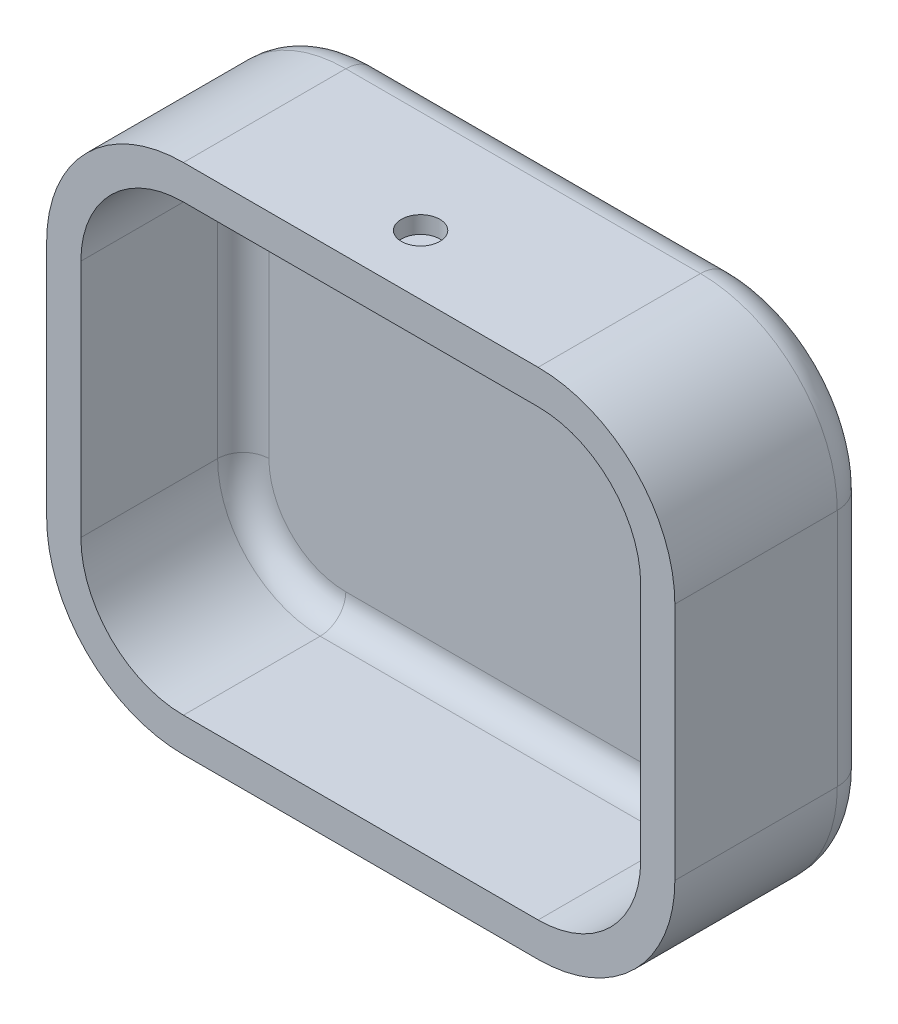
ISO-10303-21;
HEADER;
FILE_DESCRIPTION(('STEP AP214'),'2;1');
FILE_NAME('part.step','',(''),(''),'','','');
FILE_SCHEMA(('AUTOMOTIVE_DESIGN { 1 0 10303 214 1 1 1 1 }'));
ENDSEC;
DATA;
#1=APPLICATION_CONTEXT('core data for automotive mechanical design processes');
#2=APPLICATION_PROTOCOL_DEFINITION('international standard','automotive_design',2000,#1);
#3=PRODUCT_CONTEXT('',#1,'mechanical');
#4=PRODUCT('Part','Part','',(#3));
#5=PRODUCT_RELATED_PRODUCT_CATEGORY('part','',(#4));
#6=PRODUCT_DEFINITION_FORMATION('','',#4);
#7=PRODUCT_DEFINITION_CONTEXT('part definition',#1,'design');
#8=PRODUCT_DEFINITION('design','',#6,#7);
#9=PRODUCT_DEFINITION_SHAPE('','',#8);
#10=(LENGTH_UNIT() NAMED_UNIT(*) SI_UNIT(.MILLI.,.METRE.));
#11=(NAMED_UNIT(*) PLANE_ANGLE_UNIT() SI_UNIT($,.RADIAN.));
#12=(NAMED_UNIT(*) SI_UNIT($,.STERADIAN.) SOLID_ANGLE_UNIT());
#13=UNCERTAINTY_MEASURE_WITH_UNIT(LENGTH_MEASURE(1.E-05),#10,'distance_accuracy_value','');
#14=(GEOMETRIC_REPRESENTATION_CONTEXT(3) GLOBAL_UNCERTAINTY_ASSIGNED_CONTEXT((#13)) GLOBAL_UNIT_ASSIGNED_CONTEXT((#10,
#11,#12)) REPRESENTATION_CONTEXT('',''));
#15=CARTESIAN_POINT('',(0.,0.,0.));
#16=DIRECTION('',(0.,0.,1.));
#17=DIRECTION('',(1.,0.,0.));
#18=AXIS2_PLACEMENT_3D('',#15,#16,#17);
#19=CARTESIAN_POINT('',(12.,40.,19.));
#20=DIRECTION('',(0.,0.,1.));
#21=DIRECTION('',(1.,0.,0.));
#22=AXIS2_PLACEMENT_3D('',#19,#20,#21);
#23=PLANE('',#22);
#24=CARTESIAN_POINT('',(12.,40.,19.));
#25=DIRECTION('',(0.,0.,1.));
#26=DIRECTION('',(1.,0.,0.));
#27=AXIS2_PLACEMENT_3D('',#24,#25,#26);
#28=CIRCLE('',#27,16.);
#29=CARTESIAN_POINT('',(12.0000000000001,56.,19.));
#30=VERTEX_POINT('',#29);
#31=CARTESIAN_POINT('',(-4.,39.9999999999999,19.));
#32=VERTEX_POINT('',#31);
#33=EDGE_CURVE('E216',#30,#32,#28,.T.);
#34=ORIENTED_EDGE('',*,*,#33,.T.);
#35=DIRECTION('',(0.,-1.,0.));
#36=VECTOR('',#35,1.);
#37=CARTESIAN_POINT('',(-4.,12.0000000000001,19.));
#38=LINE('',#37,#36);
#39=CARTESIAN_POINT('',(-4.,12.0000000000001,19.));
#40=VERTEX_POINT('',#39);
#41=EDGE_CURVE('E253',#32,#40,#38,.T.);
#42=ORIENTED_EDGE('',*,*,#41,.T.);
#43=CARTESIAN_POINT('',(12.,12.,19.));
#44=DIRECTION('',(0.,0.,1.));
#45=DIRECTION('',(1.,0.,0.));
#46=AXIS2_PLACEMENT_3D('',#43,#44,#45);
#47=CIRCLE('',#46,16.);
#48=CARTESIAN_POINT('',(12.0000000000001,-4.,19.));
#49=VERTEX_POINT('',#48);
#50=EDGE_CURVE('E255',#40,#49,#47,.T.);
#51=ORIENTED_EDGE('',*,*,#50,.T.);
#52=DIRECTION('',(1.,0.,0.));
#53=VECTOR('',#52,1.);
#54=CARTESIAN_POINT('',(53.4999999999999,-4.,19.));
#55=LINE('',#54,#53);
#56=CARTESIAN_POINT('',(53.4999999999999,-4.,19.));
#57=VERTEX_POINT('',#56);
#58=EDGE_CURVE('E257',#49,#57,#55,.T.);
#59=ORIENTED_EDGE('',*,*,#58,.T.);
#60=CARTESIAN_POINT('',(53.5,12.,19.));
#61=DIRECTION('',(0.,0.,1.));
#62=DIRECTION('',(1.,0.,0.));
#63=AXIS2_PLACEMENT_3D('',#60,#61,#62);
#64=CIRCLE('',#63,16.);
#65=CARTESIAN_POINT('',(69.5,12.0000000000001,19.));
#66=VERTEX_POINT('',#65);
#67=EDGE_CURVE('E259',#57,#66,#64,.T.);
#68=ORIENTED_EDGE('',*,*,#67,.T.);
#69=DIRECTION('',(0.,1.,0.));
#70=VECTOR('',#69,1.);
#71=CARTESIAN_POINT('',(69.5,39.9999999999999,19.));
#72=LINE('',#71,#70);
#73=CARTESIAN_POINT('',(69.5,39.9999999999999,19.));
#74=VERTEX_POINT('',#73);
#75=EDGE_CURVE('E261',#66,#74,#72,.T.);
#76=ORIENTED_EDGE('',*,*,#75,.T.);
#77=CARTESIAN_POINT('',(53.5,40.,19.));
#78=DIRECTION('',(0.,0.,1.));
#79=DIRECTION('',(1.,0.,0.));
#80=AXIS2_PLACEMENT_3D('',#77,#78,#79);
#81=CIRCLE('',#80,16.);
#82=CARTESIAN_POINT('',(53.4999999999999,56.,19.));
#83=VERTEX_POINT('',#82);
#84=EDGE_CURVE('E263',#74,#83,#81,.T.);
#85=ORIENTED_EDGE('',*,*,#84,.T.);
#86=DIRECTION('',(-1.,0.,0.));
#87=VECTOR('',#86,1.);
#88=CARTESIAN_POINT('',(12.0000000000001,56.,19.));
#89=LINE('',#88,#87);
#90=EDGE_CURVE('E265',#83,#30,#89,.T.);
#91=ORIENTED_EDGE('',*,*,#90,.T.);
#92=EDGE_LOOP('',(#34,#42,#51,#59,#68,#76,#85,#91));
#93=FACE_BOUND('',#92,.T.);
#94=DIRECTION('',(1.,0.,0.));
#95=VECTOR('',#94,1.);
#96=CARTESIAN_POINT('',(53.4999999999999,0.,19.));
#97=LINE('',#96,#95);
#98=CARTESIAN_POINT('',(12.0000000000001,0.,19.));
#99=VERTEX_POINT('',#98);
#100=CARTESIAN_POINT('',(53.4999999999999,0.,19.));
#101=VERTEX_POINT('',#100);
#102=EDGE_CURVE('E207',#99,#101,#97,.T.);
#103=ORIENTED_EDGE('',*,*,#102,.F.);
#104=CARTESIAN_POINT('',(12.,12.,19.));
#105=DIRECTION('',(0.,0.,1.));
#106=DIRECTION('',(1.,0.,0.));
#107=AXIS2_PLACEMENT_3D('',#104,#105,#106);
#108=CIRCLE('',#107,12.);
#109=CARTESIAN_POINT('',(0.,12.0000000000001,19.));
#110=VERTEX_POINT('',#109);
#111=EDGE_CURVE('E197',#110,#99,#108,.T.);
#112=ORIENTED_EDGE('',*,*,#111,.F.);
#113=DIRECTION('',(0.,-1.,0.));
#114=VECTOR('',#113,1.);
#115=CARTESIAN_POINT('',(0.,12.0000000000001,19.));
#116=LINE('',#115,#114);
#117=CARTESIAN_POINT('',(0.,39.9999999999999,19.));
#118=VERTEX_POINT('',#117);
#119=EDGE_CURVE('E235',#118,#110,#116,.T.);
#120=ORIENTED_EDGE('',*,*,#119,.F.);
#121=CARTESIAN_POINT('',(12.,40.,19.));
#122=DIRECTION('',(0.,0.,1.));
#123=DIRECTION('',(1.,0.,0.));
#124=AXIS2_PLACEMENT_3D('',#121,#122,#123);
#125=CIRCLE('',#124,12.);
#126=CARTESIAN_POINT('',(12.0000000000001,52.,19.));
#127=VERTEX_POINT('',#126);
#128=EDGE_CURVE('E232',#127,#118,#125,.T.);
#129=ORIENTED_EDGE('',*,*,#128,.F.);
#130=DIRECTION('',(-1.,0.,0.));
#131=VECTOR('',#130,1.);
#132=CARTESIAN_POINT('',(12.0000000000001,52.,19.));
#133=LINE('',#132,#131);
#134=CARTESIAN_POINT('',(53.4999999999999,52.,19.));
#135=VERTEX_POINT('',#134);
#136=EDGE_CURVE('E230',#135,#127,#133,.T.);
#137=ORIENTED_EDGE('',*,*,#136,.F.);
#138=CARTESIAN_POINT('',(53.5,40.,19.));
#139=DIRECTION('',(0.,0.,1.));
#140=DIRECTION('',(1.,0.,0.));
#141=AXIS2_PLACEMENT_3D('',#138,#139,#140);
#142=CIRCLE('',#141,12.);
#143=CARTESIAN_POINT('',(65.5,39.9999999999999,19.));
#144=VERTEX_POINT('',#143);
#145=EDGE_CURVE('E228',#144,#135,#142,.T.);
#146=ORIENTED_EDGE('',*,*,#145,.F.);
#147=DIRECTION('',(0.,1.,0.));
#148=VECTOR('',#147,1.);
#149=CARTESIAN_POINT('',(65.5,39.9999999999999,19.));
#150=LINE('',#149,#148);
#151=CARTESIAN_POINT('',(65.5,12.0000000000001,19.));
#152=VERTEX_POINT('',#151);
#153=EDGE_CURVE('E223',#152,#144,#150,.T.);
#154=ORIENTED_EDGE('',*,*,#153,.F.);
#155=CARTESIAN_POINT('',(53.5,12.,19.));
#156=DIRECTION('',(0.,0.,1.));
#157=DIRECTION('',(1.,0.,0.));
#158=AXIS2_PLACEMENT_3D('',#155,#156,#157);
#159=CIRCLE('',#158,12.);
#160=EDGE_CURVE('E221',#101,#152,#159,.T.);
#161=ORIENTED_EDGE('',*,*,#160,.F.);
#162=EDGE_LOOP('',(#103,#112,#120,#129,#137,#146,#154,#161));
#163=FACE_BOUND('',#162,.T.);
#164=ADVANCED_FACE('F33',(#93,#163),#23,.T.);
#165=CARTESIAN_POINT('',(12.,40.,19.));
#166=DIRECTION('',(0.,0.,-1.));
#167=DIRECTION('',(-1.,0.,0.));
#168=AXIS2_PLACEMENT_3D('',#165,#166,#167);
#169=CYLINDRICAL_SURFACE('',#168,16.);
#170=DIRECTION('',(0.,0.,-1.));
#171=VECTOR('',#170,1.);
#172=CARTESIAN_POINT('',(12.0000000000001,56.,19.));
#173=LINE('',#172,#171);
#174=CARTESIAN_POINT('',(12.0000000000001,56.,0.));
#175=VERTEX_POINT('',#174);
#176=EDGE_CURVE('E267',#30,#175,#173,.T.);
#177=ORIENTED_EDGE('',*,*,#176,.T.);
#178=CARTESIAN_POINT('',(12.,40.,0.));
#179=DIRECTION('',(0.,0.,-1.));
#180=DIRECTION('',(-1.,0.,0.));
#181=AXIS2_PLACEMENT_3D('',#178,#179,#180);
#182=CIRCLE('',#181,16.);
#183=CARTESIAN_POINT('',(-4.,39.9999999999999,0.));
#184=VERTEX_POINT('',#183);
#185=EDGE_CURVE('E308',#175,#184,#182,.F.);
#186=ORIENTED_EDGE('',*,*,#185,.T.);
#187=DIRECTION('',(0.,0.,-1.));
#188=VECTOR('',#187,1.);
#189=CARTESIAN_POINT('',(-4.,39.9999999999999,19.));
#190=LINE('',#189,#188);
#191=EDGE_CURVE('E288',#32,#184,#190,.T.);
#192=ORIENTED_EDGE('',*,*,#191,.F.);
#193=ORIENTED_EDGE('',*,*,#33,.F.);
#194=EDGE_LOOP('',(#177,#186,#192,#193));
#195=FACE_BOUND('',#194,.T.);
#196=ADVANCED_FACE('F455',(#195),#169,.T.);
#197=CARTESIAN_POINT('',(-4.,12.0000000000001,19.));
#198=DIRECTION('',(1.,0.,0.));
#199=DIRECTION('',(0.,0.,-1.));
#200=AXIS2_PLACEMENT_3D('',#197,#198,#199);
#201=PLANE('',#200);
#202=ORIENTED_EDGE('',*,*,#191,.T.);
#203=DIRECTION('',(0.,1.,0.));
#204=VECTOR('',#203,1.);
#205=CARTESIAN_POINT('',(-4.,12.0000000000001,0.));
#206=LINE('',#205,#204);
#207=CARTESIAN_POINT('',(-4.,12.0000000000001,0.));
#208=VERTEX_POINT('',#207);
#209=EDGE_CURVE('E311',#184,#208,#206,.F.);
#210=ORIENTED_EDGE('',*,*,#209,.T.);
#211=DIRECTION('',(0.,0.,-1.));
#212=VECTOR('',#211,1.);
#213=CARTESIAN_POINT('',(-4.,12.0000000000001,19.));
#214=LINE('',#213,#212);
#215=EDGE_CURVE('E285',#40,#208,#214,.T.);
#216=ORIENTED_EDGE('',*,*,#215,.F.);
#217=ORIENTED_EDGE('',*,*,#41,.F.);
#218=EDGE_LOOP('',(#202,#210,#216,#217));
#219=FACE_BOUND('',#218,.T.);
#220=ADVANCED_FACE('F461',(#219),#201,.F.);
#221=CARTESIAN_POINT('',(12.,12.,19.));
#222=DIRECTION('',(0.,0.,-1.));
#223=DIRECTION('',(-1.,0.,0.));
#224=AXIS2_PLACEMENT_3D('',#221,#222,#223);
#225=CYLINDRICAL_SURFACE('',#224,16.);
#226=ORIENTED_EDGE('',*,*,#215,.T.);
#227=CARTESIAN_POINT('',(12.,12.,0.));
#228=DIRECTION('',(0.,0.,-1.));
#229=DIRECTION('',(-1.,0.,0.));
#230=AXIS2_PLACEMENT_3D('',#227,#228,#229);
#231=CIRCLE('',#230,16.);
#232=CARTESIAN_POINT('',(12.0000000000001,-4.,0.));
#233=VERTEX_POINT('',#232);
#234=EDGE_CURVE('E313',#208,#233,#231,.F.);
#235=ORIENTED_EDGE('',*,*,#234,.T.);
#236=DIRECTION('',(0.,0.,-1.));
#237=VECTOR('',#236,1.);
#238=CARTESIAN_POINT('',(12.0000000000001,-4.,19.));
#239=LINE('',#238,#237);
#240=EDGE_CURVE('E282',#49,#233,#239,.T.);
#241=ORIENTED_EDGE('',*,*,#240,.F.);
#242=ORIENTED_EDGE('',*,*,#50,.F.);
#243=EDGE_LOOP('',(#226,#235,#241,#242));
#244=FACE_BOUND('',#243,.T.);
#245=ADVANCED_FACE('F486',(#244),#225,.T.);
#246=CARTESIAN_POINT('',(53.4999999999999,-4.,19.));
#247=DIRECTION('',(0.,1.,0.));
#248=DIRECTION('',(-1.,0.,0.));
#249=AXIS2_PLACEMENT_3D('',#246,#247,#248);
#250=PLANE('',#249);
#251=CARTESIAN_POINT('',(32.75,-4.,12.));
#252=DIRECTION('',(0.,-1.,0.));
#253=DIRECTION('',(1.,0.,0.));
#254=AXIS2_PLACEMENT_3D('',#251,#252,#253);
#255=CIRCLE('',#254,2.25);
#256=CARTESIAN_POINT('',(35.,-4.,12.));
#257=VERTEX_POINT('',#256);
#258=EDGE_CURVE('E869',#257,#257,#255,.T.);
#259=ORIENTED_EDGE('',*,*,#258,.F.);
#260=EDGE_LOOP('',(#259));
#261=FACE_BOUND('',#260,.T.);
#262=ORIENTED_EDGE('',*,*,#240,.T.);
#263=DIRECTION('',(-1.,0.,0.));
#264=VECTOR('',#263,1.);
#265=CARTESIAN_POINT('',(53.4999999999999,-4.,0.));
#266=LINE('',#265,#264);
#267=CARTESIAN_POINT('',(53.4999999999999,-4.,0.));
#268=VERTEX_POINT('',#267);
#269=EDGE_CURVE('E315',#233,#268,#266,.F.);
#270=ORIENTED_EDGE('',*,*,#269,.T.);
#271=DIRECTION('',(0.,0.,-1.));
#272=VECTOR('',#271,1.);
#273=CARTESIAN_POINT('',(53.4999999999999,-4.,19.));
#274=LINE('',#273,#272);
#275=EDGE_CURVE('E279',#57,#268,#274,.T.);
#276=ORIENTED_EDGE('',*,*,#275,.F.);
#277=ORIENTED_EDGE('',*,*,#58,.F.);
#278=EDGE_LOOP('',(#262,#270,#276,#277));
#279=FACE_BOUND('',#278,.T.);
#280=ADVANCED_FACE('F482',(#261,#279),#250,.F.);
#281=CARTESIAN_POINT('',(53.5,12.,19.));
#282=DIRECTION('',(0.,0.,-1.));
#283=DIRECTION('',(-1.,0.,0.));
#284=AXIS2_PLACEMENT_3D('',#281,#282,#283);
#285=CYLINDRICAL_SURFACE('',#284,16.);
#286=ORIENTED_EDGE('',*,*,#275,.T.);
#287=CARTESIAN_POINT('',(53.5,12.,0.));
#288=DIRECTION('',(0.,0.,-1.));
#289=DIRECTION('',(-1.,0.,0.));
#290=AXIS2_PLACEMENT_3D('',#287,#288,#289);
#291=CIRCLE('',#290,16.);
#292=CARTESIAN_POINT('',(69.5,12.0000000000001,0.));
#293=VERTEX_POINT('',#292);
#294=EDGE_CURVE('E317',#268,#293,#291,.F.);
#295=ORIENTED_EDGE('',*,*,#294,.T.);
#296=DIRECTION('',(0.,0.,-1.));
#297=VECTOR('',#296,1.);
#298=CARTESIAN_POINT('',(69.5,12.0000000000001,19.));
#299=LINE('',#298,#297);
#300=EDGE_CURVE('E276',#66,#293,#299,.T.);
#301=ORIENTED_EDGE('',*,*,#300,.F.);
#302=ORIENTED_EDGE('',*,*,#67,.F.);
#303=EDGE_LOOP('',(#286,#295,#301,#302));
#304=FACE_BOUND('',#303,.T.);
#305=ADVANCED_FACE('F478',(#304),#285,.T.);
#306=CARTESIAN_POINT('',(69.5,39.9999999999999,19.));
#307=DIRECTION('',(-1.,0.,0.));
#308=DIRECTION('',(0.,0.,1.));
#309=AXIS2_PLACEMENT_3D('',#306,#307,#308);
#310=PLANE('',#309);
#311=ORIENTED_EDGE('',*,*,#300,.T.);
#312=DIRECTION('',(0.,-1.,0.));
#313=VECTOR('',#312,1.);
#314=CARTESIAN_POINT('',(69.5,39.9999999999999,0.));
#315=LINE('',#314,#313);
#316=CARTESIAN_POINT('',(69.5,39.9999999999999,0.));
#317=VERTEX_POINT('',#316);
#318=EDGE_CURVE('E319',#293,#317,#315,.F.);
#319=ORIENTED_EDGE('',*,*,#318,.T.);
#320=DIRECTION('',(0.,0.,-1.));
#321=VECTOR('',#320,1.);
#322=CARTESIAN_POINT('',(69.5,39.9999999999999,19.));
#323=LINE('',#322,#321);
#324=EDGE_CURVE('E273',#74,#317,#323,.T.);
#325=ORIENTED_EDGE('',*,*,#324,.F.);
#326=ORIENTED_EDGE('',*,*,#75,.F.);
#327=EDGE_LOOP('',(#311,#319,#325,#326));
#328=FACE_BOUND('',#327,.T.);
#329=ADVANCED_FACE('F474',(#328),#310,.F.);
#330=CARTESIAN_POINT('',(53.5,40.,19.));
#331=DIRECTION('',(0.,0.,-1.));
#332=DIRECTION('',(-1.,0.,0.));
#333=AXIS2_PLACEMENT_3D('',#330,#331,#332);
#334=CYLINDRICAL_SURFACE('',#333,16.);
#335=ORIENTED_EDGE('',*,*,#324,.T.);
#336=CARTESIAN_POINT('',(53.5,40.,0.));
#337=DIRECTION('',(0.,0.,-1.));
#338=DIRECTION('',(-1.,0.,0.));
#339=AXIS2_PLACEMENT_3D('',#336,#337,#338);
#340=CIRCLE('',#339,16.);
#341=CARTESIAN_POINT('',(53.4999999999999,56.,0.));
#342=VERTEX_POINT('',#341);
#343=EDGE_CURVE('E321',#317,#342,#340,.F.);
#344=ORIENTED_EDGE('',*,*,#343,.T.);
#345=DIRECTION('',(0.,0.,-1.));
#346=VECTOR('',#345,1.);
#347=CARTESIAN_POINT('',(53.4999999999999,56.,19.));
#348=LINE('',#347,#346);
#349=EDGE_CURVE('E270',#83,#342,#348,.T.);
#350=ORIENTED_EDGE('',*,*,#349,.F.);
#351=ORIENTED_EDGE('',*,*,#84,.F.);
#352=EDGE_LOOP('',(#335,#344,#350,#351));
#353=FACE_BOUND('',#352,.T.);
#354=ADVANCED_FACE('F470',(#353),#334,.T.);
#355=CARTESIAN_POINT('',(12.0000000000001,56.,19.));
#356=DIRECTION('',(0.,-1.,0.));
#357=DIRECTION('',(0.,0.,-1.));
#358=AXIS2_PLACEMENT_3D('',#355,#356,#357);
#359=PLANE('',#358);
#360=CARTESIAN_POINT('',(32.75,56.,12.));
#361=DIRECTION('',(0.,1.,0.));
#362=DIRECTION('',(0.,0.,1.));
#363=AXIS2_PLACEMENT_3D('',#360,#361,#362);
#364=CIRCLE('',#363,2.25);
#365=CARTESIAN_POINT('',(32.75,56.,14.25));
#366=VERTEX_POINT('',#365);
#367=EDGE_CURVE('E868',#366,#366,#364,.T.);
#368=ORIENTED_EDGE('',*,*,#367,.F.);
#369=EDGE_LOOP('',(#368));
#370=FACE_BOUND('',#369,.T.);
#371=ORIENTED_EDGE('',*,*,#349,.T.);
#372=DIRECTION('',(1.,0.,0.));
#373=VECTOR('',#372,1.);
#374=CARTESIAN_POINT('',(12.0000000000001,56.,0.));
#375=LINE('',#374,#373);
#376=EDGE_CURVE('E323',#342,#175,#375,.F.);
#377=ORIENTED_EDGE('',*,*,#376,.T.);
#378=ORIENTED_EDGE('',*,*,#176,.F.);
#379=ORIENTED_EDGE('',*,*,#90,.F.);
#380=EDGE_LOOP('',(#371,#377,#378,#379));
#381=FACE_BOUND('',#380,.T.);
#382=ADVANCED_FACE('F467',(#370,#381),#359,.F.);
#383=CARTESIAN_POINT('',(12.,12.,19.));
#384=DIRECTION('',(0.,0.,-1.));
#385=DIRECTION('',(-1.,0.,0.));
#386=AXIS2_PLACEMENT_3D('',#383,#384,#385);
#387=CYLINDRICAL_SURFACE('',#386,12.);
#388=DIRECTION('',(0.,0.,-1.));
#389=VECTOR('',#388,1.);
#390=CARTESIAN_POINT('',(12.0000000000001,0.,19.));
#391=LINE('',#390,#389);
#392=CARTESIAN_POINT('',(12.0000000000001,0.,3.));
#393=VERTEX_POINT('',#392);
#394=EDGE_CURVE('E200',#99,#393,#391,.T.);
#395=ORIENTED_EDGE('',*,*,#394,.T.);
#396=CARTESIAN_POINT('',(12.,12.,3.));
#397=DIRECTION('',(0.,0.,-1.));
#398=DIRECTION('',(-1.,0.,0.));
#399=AXIS2_PLACEMENT_3D('',#396,#397,#398);
#400=CIRCLE('',#399,12.);
#401=CARTESIAN_POINT('',(0.,12.0000000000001,3.));
#402=VERTEX_POINT('',#401);
#403=EDGE_CURVE('E369',#393,#402,#400,.T.);
#404=ORIENTED_EDGE('',*,*,#403,.T.);
#405=DIRECTION('',(0.,0.,-1.));
#406=VECTOR('',#405,1.);
#407=CARTESIAN_POINT('',(0.,12.0000000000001,19.));
#408=LINE('',#407,#406);
#409=EDGE_CURVE('E203',#110,#402,#408,.T.);
#410=ORIENTED_EDGE('',*,*,#409,.F.);
#411=ORIENTED_EDGE('',*,*,#111,.T.);
#412=EDGE_LOOP('',(#395,#404,#410,#411));
#413=FACE_BOUND('',#412,.T.);
#414=ADVANCED_FACE('F199',(#413),#387,.F.);
#415=CARTESIAN_POINT('',(53.4999999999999,0.,19.));
#416=DIRECTION('',(0.,1.,0.));
#417=DIRECTION('',(-1.,0.,0.));
#418=AXIS2_PLACEMENT_3D('',#415,#416,#417);
#419=PLANE('',#418);
#420=DIRECTION('',(0.,0.,-1.));
#421=VECTOR('',#420,1.);
#422=CARTESIAN_POINT('',(53.4999999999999,0.,19.));
#423=LINE('',#422,#421);
#424=CARTESIAN_POINT('',(53.4999999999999,0.,3.));
#425=VERTEX_POINT('',#424);
#426=EDGE_CURVE('E217',#101,#425,#423,.T.);
#427=ORIENTED_EDGE('',*,*,#426,.T.);
#428=DIRECTION('',(1.,0.,0.));
#429=VECTOR('',#428,1.);
#430=CARTESIAN_POINT('',(53.4999999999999,0.,3.));
#431=LINE('',#430,#429);
#432=EDGE_CURVE('E215',#425,#393,#431,.F.);
#433=ORIENTED_EDGE('',*,*,#432,.T.);
#434=ORIENTED_EDGE('',*,*,#394,.F.);
#435=ORIENTED_EDGE('',*,*,#102,.T.);
#436=EDGE_LOOP('',(#427,#433,#434,#435));
#437=FACE_BOUND('',#436,.T.);
#438=ADVANCED_FACE('F212',(#437),#419,.T.);
#439=CARTESIAN_POINT('',(53.5,12.,19.));
#440=DIRECTION('',(0.,0.,-1.));
#441=DIRECTION('',(-1.,0.,0.));
#442=AXIS2_PLACEMENT_3D('',#439,#440,#441);
#443=CYLINDRICAL_SURFACE('',#442,12.);
#444=DIRECTION('',(0.,0.,-1.));
#445=VECTOR('',#444,1.);
#446=CARTESIAN_POINT('',(65.5,12.0000000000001,19.));
#447=LINE('',#446,#445);
#448=CARTESIAN_POINT('',(65.5,12.0000000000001,3.));
#449=VERTEX_POINT('',#448);
#450=EDGE_CURVE('E247',#152,#449,#447,.T.);
#451=ORIENTED_EDGE('',*,*,#450,.T.);
#452=CARTESIAN_POINT('',(53.5,12.,3.));
#453=DIRECTION('',(0.,0.,-1.));
#454=DIRECTION('',(-1.,0.,0.));
#455=AXIS2_PLACEMENT_3D('',#452,#453,#454);
#456=CIRCLE('',#455,12.);
#457=EDGE_CURVE('E366',#449,#425,#456,.T.);
#458=ORIENTED_EDGE('',*,*,#457,.T.);
#459=ORIENTED_EDGE('',*,*,#426,.F.);
#460=ORIENTED_EDGE('',*,*,#160,.T.);
#461=EDGE_LOOP('',(#451,#458,#459,#460));
#462=FACE_BOUND('',#461,.T.);
#463=ADVANCED_FACE('F436',(#462),#443,.F.);
#464=CARTESIAN_POINT('',(65.5,39.9999999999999,19.));
#465=DIRECTION('',(-1.,0.,0.));
#466=DIRECTION('',(0.,0.,1.));
#467=AXIS2_PLACEMENT_3D('',#464,#465,#466);
#468=PLANE('',#467);
#469=DIRECTION('',(0.,0.,-1.));
#470=VECTOR('',#469,1.);
#471=CARTESIAN_POINT('',(65.5,39.9999999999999,19.));
#472=LINE('',#471,#470);
#473=CARTESIAN_POINT('',(65.5,39.9999999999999,3.));
#474=VERTEX_POINT('',#473);
#475=EDGE_CURVE('E244',#144,#474,#472,.T.);
#476=ORIENTED_EDGE('',*,*,#475,.T.);
#477=DIRECTION('',(0.,1.,0.));
#478=VECTOR('',#477,1.);
#479=CARTESIAN_POINT('',(65.5,39.9999999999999,3.));
#480=LINE('',#479,#478);
#481=EDGE_CURVE('E363',#474,#449,#480,.F.);
#482=ORIENTED_EDGE('',*,*,#481,.T.);
#483=ORIENTED_EDGE('',*,*,#450,.F.);
#484=ORIENTED_EDGE('',*,*,#153,.T.);
#485=EDGE_LOOP('',(#476,#482,#483,#484));
#486=FACE_BOUND('',#485,.T.);
#487=ADVANCED_FACE('F434',(#486),#468,.T.);
#488=CARTESIAN_POINT('',(53.5,40.,19.));
#489=DIRECTION('',(0.,0.,-1.));
#490=DIRECTION('',(-1.,0.,0.));
#491=AXIS2_PLACEMENT_3D('',#488,#489,#490);
#492=CYLINDRICAL_SURFACE('',#491,12.);
#493=DIRECTION('',(0.,0.,-1.));
#494=VECTOR('',#493,1.);
#495=CARTESIAN_POINT('',(53.4999999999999,52.,19.));
#496=LINE('',#495,#494);
#497=CARTESIAN_POINT('',(53.4999999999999,52.,3.));
#498=VERTEX_POINT('',#497);
#499=EDGE_CURVE('E242',#135,#498,#496,.T.);
#500=ORIENTED_EDGE('',*,*,#499,.T.);
#501=CARTESIAN_POINT('',(53.5,40.,3.));
#502=DIRECTION('',(0.,0.,-1.));
#503=DIRECTION('',(-1.,0.,0.));
#504=AXIS2_PLACEMENT_3D('',#501,#502,#503);
#505=CIRCLE('',#504,12.);
#506=EDGE_CURVE('E373',#498,#474,#505,.T.);
#507=ORIENTED_EDGE('',*,*,#506,.T.);
#508=ORIENTED_EDGE('',*,*,#475,.F.);
#509=ORIENTED_EDGE('',*,*,#145,.T.);
#510=EDGE_LOOP('',(#500,#507,#508,#509));
#511=FACE_BOUND('',#510,.T.);
#512=ADVANCED_FACE('F416',(#511),#492,.F.);
#513=CARTESIAN_POINT('',(12.0000000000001,52.,19.));
#514=DIRECTION('',(0.,-1.,0.));
#515=DIRECTION('',(0.,0.,-1.));
#516=AXIS2_PLACEMENT_3D('',#513,#514,#515);
#517=PLANE('',#516);
#518=DIRECTION('',(0.,0.,-1.));
#519=VECTOR('',#518,1.);
#520=CARTESIAN_POINT('',(12.0000000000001,52.,19.));
#521=LINE('',#520,#519);
#522=CARTESIAN_POINT('',(12.0000000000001,52.,3.));
#523=VERTEX_POINT('',#522);
#524=EDGE_CURVE('E240',#127,#523,#521,.T.);
#525=ORIENTED_EDGE('',*,*,#524,.T.);
#526=DIRECTION('',(-1.,0.,0.));
#527=VECTOR('',#526,1.);
#528=CARTESIAN_POINT('',(12.0000000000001,52.,3.));
#529=LINE('',#528,#527);
#530=EDGE_CURVE('E42',#523,#498,#529,.F.);
#531=ORIENTED_EDGE('',*,*,#530,.T.);
#532=ORIENTED_EDGE('',*,*,#499,.F.);
#533=ORIENTED_EDGE('',*,*,#136,.T.);
#534=EDGE_LOOP('',(#525,#531,#532,#533));
#535=FACE_BOUND('',#534,.T.);
#536=ADVANCED_FACE('F412',(#535),#517,.T.);
#537=CARTESIAN_POINT('',(12.,40.,19.));
#538=DIRECTION('',(0.,0.,-1.));
#539=DIRECTION('',(-1.,0.,0.));
#540=AXIS2_PLACEMENT_3D('',#537,#538,#539);
#541=CYLINDRICAL_SURFACE('',#540,12.);
#542=DIRECTION('',(0.,0.,-1.));
#543=VECTOR('',#542,1.);
#544=CARTESIAN_POINT('',(0.,39.9999999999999,19.));
#545=LINE('',#544,#543);
#546=CARTESIAN_POINT('',(0.,39.9999999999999,3.));
#547=VERTEX_POINT('',#546);
#548=EDGE_CURVE('E238',#118,#547,#545,.T.);
#549=ORIENTED_EDGE('',*,*,#548,.T.);
#550=CARTESIAN_POINT('',(12.,40.,3.));
#551=DIRECTION('',(0.,0.,-1.));
#552=DIRECTION('',(-1.,0.,0.));
#553=AXIS2_PLACEMENT_3D('',#550,#551,#552);
#554=CIRCLE('',#553,12.);
#555=EDGE_CURVE('E11',#547,#523,#554,.T.);
#556=ORIENTED_EDGE('',*,*,#555,.T.);
#557=ORIENTED_EDGE('',*,*,#524,.F.);
#558=ORIENTED_EDGE('',*,*,#128,.T.);
#559=EDGE_LOOP('',(#549,#556,#557,#558));
#560=FACE_BOUND('',#559,.T.);
#561=ADVANCED_FACE('F408',(#560),#541,.F.);
#562=CARTESIAN_POINT('',(0.,12.0000000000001,19.));
#563=DIRECTION('',(1.,0.,0.));
#564=DIRECTION('',(0.,0.,-1.));
#565=AXIS2_PLACEMENT_3D('',#562,#563,#564);
#566=PLANE('',#565);
#567=ORIENTED_EDGE('',*,*,#409,.T.);
#568=DIRECTION('',(0.,-1.,0.));
#569=VECTOR('',#568,1.);
#570=CARTESIAN_POINT('',(0.,12.0000000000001,3.));
#571=LINE('',#570,#569);
#572=EDGE_CURVE('E371',#402,#547,#571,.F.);
#573=ORIENTED_EDGE('',*,*,#572,.T.);
#574=ORIENTED_EDGE('',*,*,#548,.F.);
#575=ORIENTED_EDGE('',*,*,#119,.T.);
#576=EDGE_LOOP('',(#567,#573,#574,#575));
#577=FACE_BOUND('',#576,.T.);
#578=ADVANCED_FACE('F407',(#577),#566,.T.);
#579=CARTESIAN_POINT('',(53.5,40.,0.));
#580=DIRECTION('',(0.,0.,-1.));
#581=DIRECTION('',(-1.,0.,0.));
#582=AXIS2_PLACEMENT_3D('',#579,#580,#581);
#583=PLANE('',#582);
#584=CARTESIAN_POINT('',(53.5,12.,0.));
#585=DIRECTION('',(0.,0.,-1.));
#586=DIRECTION('',(-1.,0.,0.));
#587=AXIS2_PLACEMENT_3D('',#584,#585,#586);
#588=CIRCLE('',#587,9.);
#589=CARTESIAN_POINT('',(53.4999999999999,3.,0.));
#590=VERTEX_POINT('',#589);
#591=CARTESIAN_POINT('',(62.5,12.0000000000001,0.));
#592=VERTEX_POINT('',#591);
#593=EDGE_CURVE('E358',#590,#592,#588,.F.);
#594=ORIENTED_EDGE('',*,*,#593,.T.);
#595=DIRECTION('',(0.,1.,0.));
#596=VECTOR('',#595,1.);
#597=CARTESIAN_POINT('',(62.5,40.,0.));
#598=LINE('',#597,#596);
#599=CARTESIAN_POINT('',(62.5,39.9999999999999,0.));
#600=VERTEX_POINT('',#599);
#601=EDGE_CURVE('E360',#592,#600,#598,.T.);
#602=ORIENTED_EDGE('',*,*,#601,.T.);
#603=CARTESIAN_POINT('',(53.5,40.,0.));
#604=DIRECTION('',(0.,0.,-1.));
#605=DIRECTION('',(-1.,0.,0.));
#606=AXIS2_PLACEMENT_3D('',#603,#604,#605);
#607=CIRCLE('',#606,9.);
#608=CARTESIAN_POINT('',(53.4999999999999,49.,0.));
#609=VERTEX_POINT('',#608);
#610=EDGE_CURVE('E350',#600,#609,#607,.F.);
#611=ORIENTED_EDGE('',*,*,#610,.T.);
#612=DIRECTION('',(-1.,0.,0.));
#613=VECTOR('',#612,1.);
#614=CARTESIAN_POINT('',(53.5,49.,0.));
#615=LINE('',#614,#613);
#616=CARTESIAN_POINT('',(12.0000000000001,49.,0.));
#617=VERTEX_POINT('',#616);
#618=EDGE_CURVE('E348',#609,#617,#615,.T.);
#619=ORIENTED_EDGE('',*,*,#618,.T.);
#620=CARTESIAN_POINT('',(12.,40.,0.));
#621=DIRECTION('',(0.,0.,-1.));
#622=DIRECTION('',(-1.,0.,0.));
#623=AXIS2_PLACEMENT_3D('',#620,#621,#622);
#624=CIRCLE('',#623,9.);
#625=CARTESIAN_POINT('',(3.,39.9999999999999,0.));
#626=VERTEX_POINT('',#625);
#627=EDGE_CURVE('E325',#617,#626,#624,.F.);
#628=ORIENTED_EDGE('',*,*,#627,.T.);
#629=DIRECTION('',(0.,-1.,0.));
#630=VECTOR('',#629,1.);
#631=CARTESIAN_POINT('',(3.,40.,0.));
#632=LINE('',#631,#630);
#633=CARTESIAN_POINT('',(3.,12.0000000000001,0.));
#634=VERTEX_POINT('',#633);
#635=EDGE_CURVE('E352',#626,#634,#632,.T.);
#636=ORIENTED_EDGE('',*,*,#635,.T.);
#637=CARTESIAN_POINT('',(12.,12.,0.));
#638=DIRECTION('',(0.,0.,-1.));
#639=DIRECTION('',(-1.,0.,0.));
#640=AXIS2_PLACEMENT_3D('',#637,#638,#639);
#641=CIRCLE('',#640,9.);
#642=CARTESIAN_POINT('',(12.0000000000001,3.,0.));
#643=VERTEX_POINT('',#642);
#644=EDGE_CURVE('E354',#634,#643,#641,.F.);
#645=ORIENTED_EDGE('',*,*,#644,.T.);
#646=DIRECTION('',(1.,0.,0.));
#647=VECTOR('',#646,1.);
#648=CARTESIAN_POINT('',(53.5,3.,0.));
#649=LINE('',#648,#647);
#650=EDGE_CURVE('E356',#643,#590,#649,.T.);
#651=ORIENTED_EDGE('',*,*,#650,.T.);
#652=EDGE_LOOP('',(#594,#602,#611,#619,#628,#636,#645,#651));
#653=FACE_BOUND('',#652,.T.);
#654=ADVANCED_FACE('F445',(#653),#583,.F.);
#655=CARTESIAN_POINT('',(53.5,40.,-4.));
#656=DIRECTION('',(0.,0.,-1.));
#657=DIRECTION('',(-1.,0.,0.));
#658=AXIS2_PLACEMENT_3D('',#655,#656,#657);
#659=PLANE('',#658);
#660=DIRECTION('',(0.,1.,0.));
#661=VECTOR('',#660,1.);
#662=CARTESIAN_POINT('',(0.,39.9999999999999,-4.));
#663=LINE('',#662,#661);
#664=CARTESIAN_POINT('',(0.,12.0000000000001,-4.));
#665=VERTEX_POINT('',#664);
#666=CARTESIAN_POINT('',(0.,39.9999999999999,-4.));
#667=VERTEX_POINT('',#666);
#668=EDGE_CURVE('E303',#665,#667,#663,.T.);
#669=ORIENTED_EDGE('',*,*,#668,.T.);
#670=CARTESIAN_POINT('',(12.,40.,-4.));
#671=DIRECTION('',(0.,0.,-1.));
#672=DIRECTION('',(-1.,0.,0.));
#673=AXIS2_PLACEMENT_3D('',#670,#671,#672);
#674=CIRCLE('',#673,12.);
#675=CARTESIAN_POINT('',(12.0000000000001,52.,-4.));
#676=VERTEX_POINT('',#675);
#677=EDGE_CURVE('E305',#667,#676,#674,.T.);
#678=ORIENTED_EDGE('',*,*,#677,.T.);
#679=DIRECTION('',(1.,0.,0.));
#680=VECTOR('',#679,1.);
#681=CARTESIAN_POINT('',(53.4999999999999,52.,-4.));
#682=LINE('',#681,#680);
#683=CARTESIAN_POINT('',(53.4999999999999,52.,-4.));
#684=VERTEX_POINT('',#683);
#685=EDGE_CURVE('E291',#676,#684,#682,.T.);
#686=ORIENTED_EDGE('',*,*,#685,.T.);
#687=CARTESIAN_POINT('',(53.5,40.,-4.));
#688=DIRECTION('',(0.,0.,-1.));
#689=DIRECTION('',(-1.,0.,0.));
#690=AXIS2_PLACEMENT_3D('',#687,#688,#689);
#691=CIRCLE('',#690,12.);
#692=CARTESIAN_POINT('',(65.5,39.9999999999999,-4.));
#693=VERTEX_POINT('',#692);
#694=EDGE_CURVE('E293',#684,#693,#691,.T.);
#695=ORIENTED_EDGE('',*,*,#694,.T.);
#696=DIRECTION('',(0.,-1.,0.));
#697=VECTOR('',#696,1.);
#698=CARTESIAN_POINT('',(65.5,12.0000000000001,-4.));
#699=LINE('',#698,#697);
#700=CARTESIAN_POINT('',(65.5,12.0000000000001,-4.));
#701=VERTEX_POINT('',#700);
#702=EDGE_CURVE('E295',#693,#701,#699,.T.);
#703=ORIENTED_EDGE('',*,*,#702,.T.);
#704=CARTESIAN_POINT('',(53.5,12.,-4.));
#705=DIRECTION('',(0.,0.,-1.));
#706=DIRECTION('',(-1.,0.,0.));
#707=AXIS2_PLACEMENT_3D('',#704,#705,#706);
#708=CIRCLE('',#707,12.);
#709=CARTESIAN_POINT('',(53.4999999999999,0.,-4.));
#710=VERTEX_POINT('',#709);
#711=EDGE_CURVE('E297',#701,#710,#708,.T.);
#712=ORIENTED_EDGE('',*,*,#711,.T.);
#713=DIRECTION('',(-1.,0.,0.));
#714=VECTOR('',#713,1.);
#715=CARTESIAN_POINT('',(12.0000000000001,0.,-4.));
#716=LINE('',#715,#714);
#717=CARTESIAN_POINT('',(12.0000000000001,0.,-4.));
#718=VERTEX_POINT('',#717);
#719=EDGE_CURVE('E299',#710,#718,#716,.T.);
#720=ORIENTED_EDGE('',*,*,#719,.T.);
#721=CARTESIAN_POINT('',(12.,12.,-4.));
#722=DIRECTION('',(0.,0.,-1.));
#723=DIRECTION('',(-1.,0.,0.));
#724=AXIS2_PLACEMENT_3D('',#721,#722,#723);
#725=CIRCLE('',#724,12.);
#726=EDGE_CURVE('E301',#718,#665,#725,.T.);
#727=ORIENTED_EDGE('',*,*,#726,.T.);
#728=EDGE_LOOP('',(#669,#678,#686,#695,#703,#712,#720,#727));
#729=FACE_BOUND('',#728,.T.);
#730=ADVANCED_FACE('F525',(#729),#659,.T.);
#731=CARTESIAN_POINT('',(53.5,12.,0.));
#732=DIRECTION('',(0.,0.,-1.));
#733=DIRECTION('',(-1.,0.,0.));
#734=AXIS2_PLACEMENT_3D('',#731,#732,#733);
#735=TOROIDAL_SURFACE('',#734,12.,4.);
#736=CARTESIAN_POINT('',(65.5,12.0000000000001,0.));
#737=DIRECTION('',(0.,1.,0.));
#738=DIRECTION('',(-1.,0.,0.));
#739=AXIS2_PLACEMENT_3D('',#736,#737,#738);
#740=CIRCLE('',#739,4.);
#741=EDGE_CURVE('E342',#293,#701,#740,.T.);
#742=ORIENTED_EDGE('',*,*,#741,.F.);
#743=ORIENTED_EDGE('',*,*,#294,.F.);
#744=CARTESIAN_POINT('',(53.4999999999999,0.,0.));
#745=DIRECTION('',(-1.,0.,0.));
#746=DIRECTION('',(0.,0.,1.));
#747=AXIS2_PLACEMENT_3D('',#744,#745,#746);
#748=CIRCLE('',#747,4.);
#749=EDGE_CURVE('E208',#710,#268,#748,.T.);
#750=ORIENTED_EDGE('',*,*,#749,.F.);
#751=ORIENTED_EDGE('',*,*,#711,.F.);
#752=EDGE_LOOP('',(#742,#743,#750,#751));
#753=FACE_BOUND('',#752,.T.);
#754=ADVANCED_FACE('F521',(#753),#735,.T.);
#755=CARTESIAN_POINT('',(53.5,0.,0.));
#756=DIRECTION('',(1.,0.,0.));
#757=DIRECTION('',(0.,1.,0.));
#758=AXIS2_PLACEMENT_3D('',#755,#756,#757);
#759=CYLINDRICAL_SURFACE('',#758,4.);
#760=ORIENTED_EDGE('',*,*,#749,.T.);
#761=ORIENTED_EDGE('',*,*,#269,.F.);
#762=CARTESIAN_POINT('',(12.0000000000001,0.,0.));
#763=DIRECTION('',(-1.,0.,0.));
#764=DIRECTION('',(0.,-1.,0.));
#765=AXIS2_PLACEMENT_3D('',#762,#763,#764);
#766=CIRCLE('',#765,4.);
#767=EDGE_CURVE('E339',#718,#233,#766,.T.);
#768=ORIENTED_EDGE('',*,*,#767,.F.);
#769=ORIENTED_EDGE('',*,*,#719,.F.);
#770=EDGE_LOOP('',(#760,#761,#768,#769));
#771=FACE_BOUND('',#770,.T.);
#772=ADVANCED_FACE('F517',(#771),#759,.T.);
#773=CARTESIAN_POINT('',(65.5,40.,0.));
#774=DIRECTION('',(0.,1.,0.));
#775=DIRECTION('',(0.,0.,1.));
#776=AXIS2_PLACEMENT_3D('',#773,#774,#775);
#777=CYLINDRICAL_SURFACE('',#776,4.);
#778=ORIENTED_EDGE('',*,*,#741,.T.);
#779=ORIENTED_EDGE('',*,*,#702,.F.);
#780=CARTESIAN_POINT('',(65.5,39.9999999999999,0.));
#781=DIRECTION('',(0.,1.,0.));
#782=DIRECTION('',(0.,0.,1.));
#783=AXIS2_PLACEMENT_3D('',#780,#781,#782);
#784=CIRCLE('',#783,4.);
#785=EDGE_CURVE('E336',#317,#693,#784,.T.);
#786=ORIENTED_EDGE('',*,*,#785,.F.);
#787=ORIENTED_EDGE('',*,*,#318,.F.);
#788=EDGE_LOOP('',(#778,#779,#786,#787));
#789=FACE_BOUND('',#788,.T.);
#790=ADVANCED_FACE('F513',(#789),#777,.T.);
#791=CARTESIAN_POINT('',(12.,12.,0.));
#792=DIRECTION('',(0.,0.,-1.));
#793=DIRECTION('',(-1.,0.,0.));
#794=AXIS2_PLACEMENT_3D('',#791,#792,#793);
#795=TOROIDAL_SURFACE('',#794,12.,4.);
#796=ORIENTED_EDGE('',*,*,#767,.T.);
#797=ORIENTED_EDGE('',*,*,#234,.F.);
#798=CARTESIAN_POINT('',(0.,12.0000000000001,0.));
#799=DIRECTION('',(0.,1.,0.));
#800=DIRECTION('',(0.,0.,1.));
#801=AXIS2_PLACEMENT_3D('',#798,#799,#800);
#802=CIRCLE('',#801,4.);
#803=EDGE_CURVE('E333',#665,#208,#802,.T.);
#804=ORIENTED_EDGE('',*,*,#803,.F.);
#805=ORIENTED_EDGE('',*,*,#726,.F.);
#806=EDGE_LOOP('',(#796,#797,#804,#805));
#807=FACE_BOUND('',#806,.T.);
#808=ADVANCED_FACE('F509',(#807),#795,.T.);
#809=CARTESIAN_POINT('',(53.5,40.,0.));
#810=DIRECTION('',(0.,0.,-1.));
#811=DIRECTION('',(-1.,0.,0.));
#812=AXIS2_PLACEMENT_3D('',#809,#810,#811);
#813=TOROIDAL_SURFACE('',#812,12.,4.);
#814=ORIENTED_EDGE('',*,*,#785,.T.);
#815=ORIENTED_EDGE('',*,*,#694,.F.);
#816=CARTESIAN_POINT('',(53.4999999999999,52.,0.));
#817=DIRECTION('',(-1.,0.,0.));
#818=DIRECTION('',(0.,-1.,0.));
#819=AXIS2_PLACEMENT_3D('',#816,#817,#818);
#820=CIRCLE('',#819,4.);
#821=EDGE_CURVE('E330',#342,#684,#820,.T.);
#822=ORIENTED_EDGE('',*,*,#821,.F.);
#823=ORIENTED_EDGE('',*,*,#343,.F.);
#824=EDGE_LOOP('',(#814,#815,#822,#823));
#825=FACE_BOUND('',#824,.T.);
#826=ADVANCED_FACE('F505',(#825),#813,.T.);
#827=CARTESIAN_POINT('',(0.,40.,0.));
#828=DIRECTION('',(0.,-1.,0.));
#829=DIRECTION('',(0.,0.,-1.));
#830=AXIS2_PLACEMENT_3D('',#827,#828,#829);
#831=CYLINDRICAL_SURFACE('',#830,4.);
#832=ORIENTED_EDGE('',*,*,#803,.T.);
#833=ORIENTED_EDGE('',*,*,#209,.F.);
#834=CARTESIAN_POINT('',(0.,39.9999999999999,0.));
#835=DIRECTION('',(0.,1.,0.));
#836=DIRECTION('',(-1.,0.,0.));
#837=AXIS2_PLACEMENT_3D('',#834,#835,#836);
#838=CIRCLE('',#837,4.);
#839=EDGE_CURVE('E328',#667,#184,#838,.T.);
#840=ORIENTED_EDGE('',*,*,#839,.F.);
#841=ORIENTED_EDGE('',*,*,#668,.F.);
#842=EDGE_LOOP('',(#832,#833,#840,#841));
#843=FACE_BOUND('',#842,.T.);
#844=ADVANCED_FACE('F501',(#843),#831,.T.);
#845=CARTESIAN_POINT('',(53.5,52.,0.));
#846=DIRECTION('',(-1.,0.,0.));
#847=DIRECTION('',(0.,0.,1.));
#848=AXIS2_PLACEMENT_3D('',#845,#846,#847);
#849=CYLINDRICAL_SURFACE('',#848,4.);
#850=ORIENTED_EDGE('',*,*,#821,.T.);
#851=ORIENTED_EDGE('',*,*,#685,.F.);
#852=CARTESIAN_POINT('',(12.0000000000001,52.,0.));
#853=DIRECTION('',(-1.,0.,0.));
#854=DIRECTION('',(0.,0.,1.));
#855=AXIS2_PLACEMENT_3D('',#852,#853,#854);
#856=CIRCLE('',#855,4.);
#857=EDGE_CURVE('E326',#175,#676,#856,.T.);
#858=ORIENTED_EDGE('',*,*,#857,.F.);
#859=ORIENTED_EDGE('',*,*,#376,.F.);
#860=EDGE_LOOP('',(#850,#851,#858,#859));
#861=FACE_BOUND('',#860,.T.);
#862=ADVANCED_FACE('F497',(#861),#849,.T.);
#863=CARTESIAN_POINT('',(12.,40.,0.));
#864=DIRECTION('',(0.,0.,-1.));
#865=DIRECTION('',(-1.,0.,0.));
#866=AXIS2_PLACEMENT_3D('',#863,#864,#865);
#867=TOROIDAL_SURFACE('',#866,12.,4.);
#868=ORIENTED_EDGE('',*,*,#839,.T.);
#869=ORIENTED_EDGE('',*,*,#185,.F.);
#870=ORIENTED_EDGE('',*,*,#857,.T.);
#871=ORIENTED_EDGE('',*,*,#677,.F.);
#872=EDGE_LOOP('',(#868,#869,#870,#871));
#873=FACE_BOUND('',#872,.T.);
#874=ADVANCED_FACE('F494',(#873),#867,.T.);
#875=CARTESIAN_POINT('',(3.,40.,3.));
#876=DIRECTION('',(0.,-1.,0.));
#877=DIRECTION('',(0.,0.,-1.));
#878=AXIS2_PLACEMENT_3D('',#875,#876,#877);
#879=CYLINDRICAL_SURFACE('',#878,3.);
#880=CARTESIAN_POINT('',(3.,39.9999999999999,3.));
#881=DIRECTION('',(0.,-1.,0.));
#882=DIRECTION('',(0.,0.,-1.));
#883=AXIS2_PLACEMENT_3D('',#880,#881,#882);
#884=CIRCLE('',#883,3.);
#885=EDGE_CURVE('E392',#547,#626,#884,.T.);
#886=ORIENTED_EDGE('',*,*,#885,.F.);
#887=ORIENTED_EDGE('',*,*,#572,.F.);
#888=CARTESIAN_POINT('',(3.,12.0000000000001,3.));
#889=DIRECTION('',(0.,1.,0.));
#890=DIRECTION('',(-1.,0.,0.));
#891=AXIS2_PLACEMENT_3D('',#888,#889,#890);
#892=CIRCLE('',#891,3.);
#893=EDGE_CURVE('E37',#634,#402,#892,.T.);
#894=ORIENTED_EDGE('',*,*,#893,.F.);
#895=ORIENTED_EDGE('',*,*,#635,.F.);
#896=EDGE_LOOP('',(#886,#887,#894,#895));
#897=FACE_BOUND('',#896,.T.);
#898=ADVANCED_FACE('F35',(#897),#879,.F.);
#899=CARTESIAN_POINT('',(12.,12.,3.));
#900=DIRECTION('',(0.,0.,-1.));
#901=DIRECTION('',(-1.,0.,0.));
#902=AXIS2_PLACEMENT_3D('',#899,#900,#901);
#903=TOROIDAL_SURFACE('',#902,9.,3.);
#904=ORIENTED_EDGE('',*,*,#893,.T.);
#905=ORIENTED_EDGE('',*,*,#403,.F.);
#906=CARTESIAN_POINT('',(12.0000000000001,3.,3.));
#907=DIRECTION('',(-1.,0.,0.));
#908=DIRECTION('',(0.,0.,1.));
#909=AXIS2_PLACEMENT_3D('',#906,#907,#908);
#910=CIRCLE('',#909,3.);
#911=EDGE_CURVE('E390',#643,#393,#910,.T.);
#912=ORIENTED_EDGE('',*,*,#911,.F.);
#913=ORIENTED_EDGE('',*,*,#644,.F.);
#914=EDGE_LOOP('',(#904,#905,#912,#913));
#915=FACE_BOUND('',#914,.T.);
#916=ADVANCED_FACE('F401',(#915),#903,.F.);
#917=CARTESIAN_POINT('',(12.,40.,3.));
#918=DIRECTION('',(0.,0.,-1.));
#919=DIRECTION('',(-1.,0.,0.));
#920=AXIS2_PLACEMENT_3D('',#917,#918,#919);
#921=TOROIDAL_SURFACE('',#920,9.,3.);
#922=ORIENTED_EDGE('',*,*,#885,.T.);
#923=ORIENTED_EDGE('',*,*,#627,.F.);
#924=CARTESIAN_POINT('',(12.0000000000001,49.,3.));
#925=DIRECTION('',(-1.,0.,0.));
#926=DIRECTION('',(0.,0.,1.));
#927=AXIS2_PLACEMENT_3D('',#924,#925,#926);
#928=CIRCLE('',#927,3.);
#929=EDGE_CURVE('E387',#523,#617,#928,.T.);
#930=ORIENTED_EDGE('',*,*,#929,.F.);
#931=ORIENTED_EDGE('',*,*,#555,.F.);
#932=EDGE_LOOP('',(#922,#923,#930,#931));
#933=FACE_BOUND('',#932,.T.);
#934=ADVANCED_FACE('F446',(#933),#921,.F.);
#935=CARTESIAN_POINT('',(53.5,3.,3.));
#936=DIRECTION('',(1.,0.,0.));
#937=DIRECTION('',(0.,1.,0.));
#938=AXIS2_PLACEMENT_3D('',#935,#936,#937);
#939=CYLINDRICAL_SURFACE('',#938,3.);
#940=ORIENTED_EDGE('',*,*,#911,.T.);
#941=ORIENTED_EDGE('',*,*,#432,.F.);
#942=CARTESIAN_POINT('',(53.4999999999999,3.,3.));
#943=DIRECTION('',(-1.,0.,0.));
#944=DIRECTION('',(0.,-1.,0.));
#945=AXIS2_PLACEMENT_3D('',#942,#943,#944);
#946=CIRCLE('',#945,3.);
#947=EDGE_CURVE('E384',#590,#425,#946,.T.);
#948=ORIENTED_EDGE('',*,*,#947,.F.);
#949=ORIENTED_EDGE('',*,*,#650,.F.);
#950=EDGE_LOOP('',(#940,#941,#948,#949));
#951=FACE_BOUND('',#950,.T.);
#952=ADVANCED_FACE('F439',(#951),#939,.F.);
#953=CARTESIAN_POINT('',(53.5,49.,3.));
#954=DIRECTION('',(-1.,0.,0.));
#955=DIRECTION('',(0.,0.,1.));
#956=AXIS2_PLACEMENT_3D('',#953,#954,#955);
#957=CYLINDRICAL_SURFACE('',#956,3.);
#958=ORIENTED_EDGE('',*,*,#929,.T.);
#959=ORIENTED_EDGE('',*,*,#618,.F.);
#960=CARTESIAN_POINT('',(53.4999999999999,49.,3.));
#961=DIRECTION('',(-1.,0.,0.));
#962=DIRECTION('',(0.,0.,1.));
#963=AXIS2_PLACEMENT_3D('',#960,#961,#962);
#964=CIRCLE('',#963,3.);
#965=EDGE_CURVE('E381',#498,#609,#964,.T.);
#966=ORIENTED_EDGE('',*,*,#965,.F.);
#967=ORIENTED_EDGE('',*,*,#530,.F.);
#968=EDGE_LOOP('',(#958,#959,#966,#967));
#969=FACE_BOUND('',#968,.T.);
#970=ADVANCED_FACE('F421',(#969),#957,.F.);
#971=CARTESIAN_POINT('',(53.5,12.,3.));
#972=DIRECTION('',(0.,0.,-1.));
#973=DIRECTION('',(-1.,0.,0.));
#974=AXIS2_PLACEMENT_3D('',#971,#972,#973);
#975=TOROIDAL_SURFACE('',#974,9.,3.);
#976=ORIENTED_EDGE('',*,*,#947,.T.);
#977=ORIENTED_EDGE('',*,*,#457,.F.);
#978=CARTESIAN_POINT('',(62.5,12.0000000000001,3.));
#979=DIRECTION('',(0.,-1.,0.));
#980=DIRECTION('',(0.,0.,-1.));
#981=AXIS2_PLACEMENT_3D('',#978,#979,#980);
#982=CIRCLE('',#981,3.);
#983=EDGE_CURVE('E378',#592,#449,#982,.T.);
#984=ORIENTED_EDGE('',*,*,#983,.F.);
#985=ORIENTED_EDGE('',*,*,#593,.F.);
#986=EDGE_LOOP('',(#976,#977,#984,#985));
#987=FACE_BOUND('',#986,.T.);
#988=ADVANCED_FACE('F443',(#987),#975,.F.);
#989=CARTESIAN_POINT('',(53.5,40.,3.));
#990=DIRECTION('',(0.,0.,-1.));
#991=DIRECTION('',(-1.,0.,0.));
#992=AXIS2_PLACEMENT_3D('',#989,#990,#991);
#993=TOROIDAL_SURFACE('',#992,9.,3.);
#994=ORIENTED_EDGE('',*,*,#965,.T.);
#995=ORIENTED_EDGE('',*,*,#610,.F.);
#996=CARTESIAN_POINT('',(62.5,39.9999999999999,3.));
#997=DIRECTION('',(0.,1.,0.));
#998=DIRECTION('',(0.,0.,1.));
#999=AXIS2_PLACEMENT_3D('',#996,#997,#998);
#1000=CIRCLE('',#999,3.);
#1001=EDGE_CURVE('E376',#474,#600,#1000,.T.);
#1002=ORIENTED_EDGE('',*,*,#1001,.F.);
#1003=ORIENTED_EDGE('',*,*,#506,.F.);
#1004=EDGE_LOOP('',(#994,#995,#1002,#1003));
#1005=FACE_BOUND('',#1004,.T.);
#1006=ADVANCED_FACE('F425',(#1005),#993,.F.);
#1007=CARTESIAN_POINT('',(62.5,40.,3.));
#1008=DIRECTION('',(0.,1.,0.));
#1009=DIRECTION('',(0.,0.,1.));
#1010=AXIS2_PLACEMENT_3D('',#1007,#1008,#1009);
#1011=CYLINDRICAL_SURFACE('',#1010,3.);
#1012=ORIENTED_EDGE('',*,*,#983,.T.);
#1013=ORIENTED_EDGE('',*,*,#481,.F.);
#1014=ORIENTED_EDGE('',*,*,#1001,.T.);
#1015=ORIENTED_EDGE('',*,*,#601,.F.);
#1016=EDGE_LOOP('',(#1012,#1013,#1014,#1015));
#1017=FACE_BOUND('',#1016,.T.);
#1018=ADVANCED_FACE('F429',(#1017),#1011,.F.);
#1019=CARTESIAN_POINT('',(32.75,54.,12.));
#1020=DIRECTION('',(0.,1.,0.));
#1021=DIRECTION('',(0.,0.,1.));
#1022=AXIS2_PLACEMENT_3D('',#1019,#1020,#1021);
#1023=CYLINDRICAL_SURFACE('',#1022,2.25);
#1024=CARTESIAN_POINT('',(32.75,54.,12.));
#1025=DIRECTION('',(0.,1.,0.));
#1026=DIRECTION('',(0.,0.,1.));
#1027=AXIS2_PLACEMENT_3D('',#1024,#1025,#1026);
#1028=CIRCLE('',#1027,2.25);
#1029=CARTESIAN_POINT('',(32.75,54.,14.25));
#1030=VERTEX_POINT('',#1029);
#1031=EDGE_CURVE('E379',#1030,#1030,#1028,.T.);
#1032=ORIENTED_EDGE('',*,*,#1031,.F.);
#1033=EDGE_LOOP('',(#1032));
#1034=FACE_BOUND('',#1033,.T.);
#1035=ORIENTED_EDGE('',*,*,#367,.T.);
#1036=EDGE_LOOP('',(#1035));
#1037=FACE_BOUND('',#1036,.T.);
#1038=ADVANCED_FACE('F529',(#1034,#1037),#1023,.F.);
#1039=CARTESIAN_POINT('',(32.75,54.,12.));
#1040=DIRECTION('',(0.,1.,0.));
#1041=DIRECTION('',(0.,0.,1.));
#1042=AXIS2_PLACEMENT_3D('',#1039,#1040,#1041);
#1043=PLANE('',#1042);
#1044=ORIENTED_EDGE('',*,*,#1031,.T.);
#1045=EDGE_LOOP('',(#1044));
#1046=FACE_BOUND('',#1045,.T.);
#1047=ADVANCED_FACE('F558',(#1046),#1043,.T.);
#1048=CARTESIAN_POINT('',(32.75,-2.,12.));
#1049=DIRECTION('',(0.,-1.,0.));
#1050=DIRECTION('',(1.,0.,0.));
#1051=AXIS2_PLACEMENT_3D('',#1048,#1049,#1050);
#1052=CYLINDRICAL_SURFACE('',#1051,2.25);
#1053=CARTESIAN_POINT('',(32.75,-2.,12.));
#1054=DIRECTION('',(0.,-1.,0.));
#1055=DIRECTION('',(1.,0.,0.));
#1056=AXIS2_PLACEMENT_3D('',#1053,#1054,#1055);
#1057=CIRCLE('',#1056,2.25);
#1058=CARTESIAN_POINT('',(35.,-2.,12.));
#1059=VERTEX_POINT('',#1058);
#1060=EDGE_CURVE('E867',#1059,#1059,#1057,.T.);
#1061=ORIENTED_EDGE('',*,*,#1060,.F.);
#1062=EDGE_LOOP('',(#1061));
#1063=FACE_BOUND('',#1062,.T.);
#1064=ORIENTED_EDGE('',*,*,#258,.T.);
#1065=EDGE_LOOP('',(#1064));
#1066=FACE_BOUND('',#1065,.T.);
#1067=ADVANCED_FACE('F566',(#1063,#1066),#1052,.F.);
#1068=CARTESIAN_POINT('',(32.75,-2.,12.));
#1069=DIRECTION('',(0.,-1.,0.));
#1070=DIRECTION('',(1.,0.,0.));
#1071=AXIS2_PLACEMENT_3D('',#1068,#1069,#1070);
#1072=PLANE('',#1071);
#1073=ORIENTED_EDGE('',*,*,#1060,.T.);
#1074=EDGE_LOOP('',(#1073));
#1075=FACE_BOUND('',#1074,.T.);
#1076=ADVANCED_FACE('F575',(#1075),#1072,.T.);
#1077=CLOSED_SHELL('',(#164,#196,#220,#245,#280,#305,#329,#354,#382,#414,#438,#463,#487,#512,
#536,#561,#578,#654,#730,#754,#772,#790,#808,#826,#844,#862,#874,#898,#916,#934,#952,#970,#988,
#1006,#1018,#1038,#1047,#1067,#1076));
#1078=MANIFOLD_SOLID_BREP('B2',#1077);
#1079=ADVANCED_BREP_SHAPE_REPRESENTATION('',(#18,#1078),#14);
#1080=SHAPE_DEFINITION_REPRESENTATION(#9,#1079);
ENDSEC;
END-ISO-10303-21;
